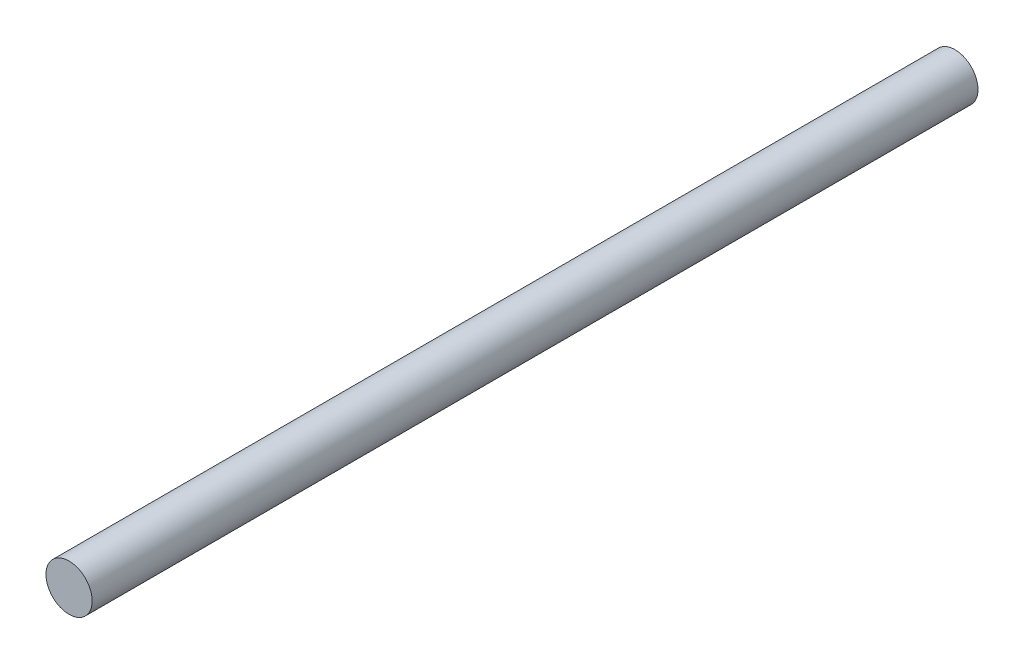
from build123d import *

# Parameters (mm, degrees)
SKETCH1_R           = 30
BOSS_EXTRUDE1_DEPTH = 1150


with BuildPart() as part:
    # Sketch1 → Boss-Extrude1 (new body)
    with BuildSketch(Plane.XY):
        Circle(SKETCH1_R)
    extrude(amount=-BOSS_EXTRUDE1_DEPTH)


solid = part.part
